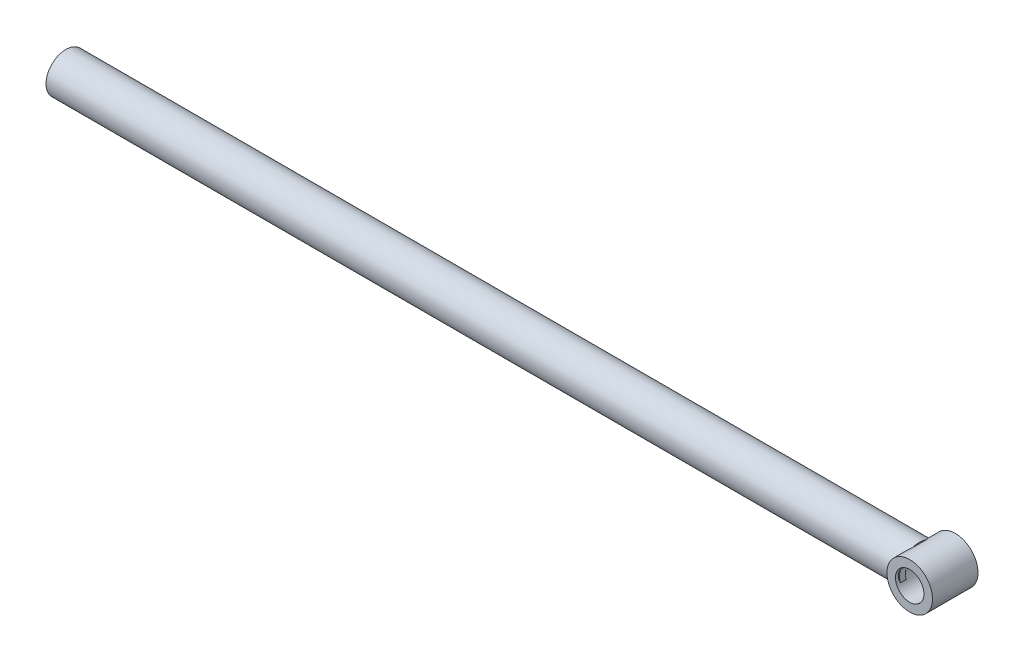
ISO-10303-21;
HEADER;
FILE_DESCRIPTION(('STEP AP214'),'2;1');
FILE_NAME('part.step','',(''),(''),'','','');
FILE_SCHEMA(('AUTOMOTIVE_DESIGN { 1 0 10303 214 1 1 1 1 }'));
ENDSEC;
DATA;
#1=APPLICATION_CONTEXT('core data for automotive mechanical design processes');
#2=APPLICATION_PROTOCOL_DEFINITION('international standard','automotive_design',2000,#1);
#3=PRODUCT_CONTEXT('',#1,'mechanical');
#4=PRODUCT('Part','Part','',(#3));
#5=PRODUCT_RELATED_PRODUCT_CATEGORY('part','',(#4));
#6=PRODUCT_DEFINITION_FORMATION('','',#4);
#7=PRODUCT_DEFINITION_CONTEXT('part definition',#1,'design');
#8=PRODUCT_DEFINITION('design','',#6,#7);
#9=PRODUCT_DEFINITION_SHAPE('','',#8);
#10=(LENGTH_UNIT() NAMED_UNIT(*) SI_UNIT(.MILLI.,.METRE.));
#11=(NAMED_UNIT(*) PLANE_ANGLE_UNIT() SI_UNIT($,.RADIAN.));
#12=(NAMED_UNIT(*) SI_UNIT($,.STERADIAN.) SOLID_ANGLE_UNIT());
#13=UNCERTAINTY_MEASURE_WITH_UNIT(LENGTH_MEASURE(1.E-05),#10,'distance_accuracy_value','');
#14=(GEOMETRIC_REPRESENTATION_CONTEXT(3) GLOBAL_UNCERTAINTY_ASSIGNED_CONTEXT((#13)) GLOBAL_UNIT_ASSIGNED_CONTEXT((#10,
#11,#12)) REPRESENTATION_CONTEXT('',''));
#15=CARTESIAN_POINT('',(0.,0.,0.));
#16=DIRECTION('',(0.,0.,1.));
#17=DIRECTION('',(1.,0.,0.));
#18=AXIS2_PLACEMENT_3D('',#15,#16,#17);
#19=CARTESIAN_POINT('',(282.839330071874,0.,16.));
#20=DIRECTION('',(0.,0.,-1.));
#21=DIRECTION('',(-1.,0.,0.));
#22=AXIS2_PLACEMENT_3D('',#19,#20,#21);
#23=CYLINDRICAL_SURFACE('',#22,7.99999999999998);
#24=CARTESIAN_POINT('',(282.839330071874,0.,0.));
#25=DIRECTION('',(0.,0.,1.));
#26=DIRECTION('',(1.,0.,0.));
#27=AXIS2_PLACEMENT_3D('',#24,#25,#26);
#28=CIRCLE('',#27,7.99999999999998);
#29=CARTESIAN_POINT('',(290.839330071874,0.,0.));
#30=VERTEX_POINT('',#29);
#31=EDGE_CURVE('E199',#30,#30,#28,.T.);
#32=ORIENTED_EDGE('',*,*,#31,.T.);
#33=EDGE_LOOP('',(#32));
#34=FACE_BOUND('',#33,.T.);
#35=CARTESIAN_POINT('',(282.839330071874,0.,16.));
#36=DIRECTION('',(0.,0.,1.));
#37=DIRECTION('',(1.,0.,0.));
#38=AXIS2_PLACEMENT_3D('',#35,#36,#37);
#39=CIRCLE('',#38,7.99999999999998);
#40=CARTESIAN_POINT('',(290.839330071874,0.,16.));
#41=VERTEX_POINT('',#40);
#42=EDGE_CURVE('E198',#41,#41,#39,.T.);
#43=ORIENTED_EDGE('',*,*,#42,.F.);
#44=EDGE_LOOP('',(#43));
#45=FACE_BOUND('',#44,.T.);
#46=CARTESIAN_POINT('',(274.839330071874,0.,15.));
#47=CARTESIAN_POINT('',(274.839328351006,0.163724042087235,15.0000017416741));
#48=CARTESIAN_POINT('',(274.844364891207,0.32742876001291,14.9942475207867));
#49=CARTESIAN_POINT('',(274.864392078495,0.653485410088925,14.971346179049));
#50=CARTESIAN_POINT('',(274.879386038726,0.81583687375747,14.9541952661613));
#51=CARTESIAN_POINT('',(274.919011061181,1.13794041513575,14.9088042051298));
#52=CARTESIAN_POINT('',(274.943651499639,1.29768980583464,14.8805532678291));
#53=CARTESIAN_POINT('',(275.002047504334,1.6133123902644,14.8134624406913));
#54=CARTESIAN_POINT('',(275.035807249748,1.76918377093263,14.7746176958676));
#55=CARTESIAN_POINT('',(275.111498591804,2.07490712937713,14.6872902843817));
#56=CARTESIAN_POINT('',(275.153371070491,2.22479372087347,14.6388772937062));
#57=CARTESIAN_POINT('',(275.2446868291,2.51895954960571,14.5329412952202));
#58=CARTESIAN_POINT('',(275.294133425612,2.66323629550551,14.4754142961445));
#59=CARTESIAN_POINT('',(275.45263866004,3.08665189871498,14.2902560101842));
#60=CARTESIAN_POINT('',(275.571924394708,3.35661746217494,14.149976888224));
#61=CARTESIAN_POINT('',(275.791390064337,3.79029989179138,13.888702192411));
#62=CARTESIAN_POINT('',(275.886261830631,3.96126665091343,13.774922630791));
#63=CARTESIAN_POINT('',(276.083940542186,4.28968393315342,13.5353299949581));
#64=CARTESIAN_POINT('',(276.186747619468,4.44713423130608,13.4095167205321));
#65=CARTESIAN_POINT('',(276.398575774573,4.74876339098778,13.1467831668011));
#66=CARTESIAN_POINT('',(276.507611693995,4.89290821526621,13.0098359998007));
#67=CARTESIAN_POINT('',(276.72972233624,5.16757907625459,12.7260047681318));
#68=CARTESIAN_POINT('',(276.842796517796,5.29810692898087,12.5791220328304));
#69=CARTESIAN_POINT('',(277.073468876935,5.54837096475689,12.2726538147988));
#70=CARTESIAN_POINT('',(277.191112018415,5.66781321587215,12.1128625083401));
#71=CARTESIAN_POINT('',(277.426217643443,5.89276496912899,11.783531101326));
#72=CARTESIAN_POINT('',(277.543680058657,5.99827008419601,11.6139879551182));
#73=CARTESIAN_POINT('',(277.775276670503,6.19502911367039,11.2652165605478));
#74=CARTESIAN_POINT('',(277.889416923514,6.28631047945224,11.0860078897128));
#75=CARTESIAN_POINT('',(278.110701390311,6.45440488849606,10.716937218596));
#76=CARTESIAN_POINT('',(278.217850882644,6.53122893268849,10.5270834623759));
#77=CARTESIAN_POINT('',(278.422849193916,6.67162261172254,10.1296053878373));
#78=CARTESIAN_POINT('',(278.520326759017,6.73473024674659,9.92162054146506));
#79=CARTESIAN_POINT('',(278.693428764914,6.84265498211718,9.49226449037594));
#80=CARTESIAN_POINT('',(278.769095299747,6.88750738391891,9.27092008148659));
#81=CARTESIAN_POINT('',(278.878240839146,6.95076975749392,8.85119634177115));
#82=CARTESIAN_POINT('',(278.916429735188,6.97219317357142,8.65454786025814));
#83=CARTESIAN_POINT('',(278.962843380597,6.99811683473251,8.25673625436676));
#84=CARTESIAN_POINT('',(278.971115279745,7.00264370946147,8.05558073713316));
#85=CARTESIAN_POINT('',(278.956168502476,6.99436184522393,7.65487564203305));
#86=CARTESIAN_POINT('',(278.932947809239,6.98155199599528,7.45532616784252));
#87=CARTESIAN_POINT('',(278.859293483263,6.93981278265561,7.06291699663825));
#88=CARTESIAN_POINT('',(278.808805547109,6.91085124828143,6.87007146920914));
#89=CARTESIAN_POINT('',(278.699646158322,6.84588885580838,6.53117623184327));
#90=CARTESIAN_POINT('',(278.644573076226,6.81241634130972,6.38341990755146));
#91=CARTESIAN_POINT('',(278.524763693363,6.73717463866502,6.09399804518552));
#92=CARTESIAN_POINT('',(278.460020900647,6.69539987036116,5.95233668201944));
#93=CARTESIAN_POINT('',(278.323430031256,6.60404572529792,5.67447830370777));
#94=CARTESIAN_POINT('',(278.251557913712,6.55443958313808,5.53830211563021));
#95=CARTESIAN_POINT('',(278.103069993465,6.4479610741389,5.271555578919));
#96=CARTESIAN_POINT('',(278.026454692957,6.39108947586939,5.14098463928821));
#97=CARTESIAN_POINT('',(277.822660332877,6.23363212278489,4.80725217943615));
#98=CARTESIAN_POINT('',(277.693041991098,6.12748053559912,4.60818566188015));
#99=CARTESIAN_POINT('',(277.430988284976,5.89748468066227,4.22242025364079));
#100=CARTESIAN_POINT('',(277.29855137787,5.77363049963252,4.03572837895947));
#101=CARTESIAN_POINT('',(277.034787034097,5.50837618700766,3.67474055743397));
#102=CARTESIAN_POINT('',(276.903458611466,5.36699391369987,3.50043227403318));
#103=CARTESIAN_POINT('',(276.645036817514,5.06656271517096,3.16463890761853));
#104=CARTESIAN_POINT('',(276.517941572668,4.90752174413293,3.00314810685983));
#105=CARTESIAN_POINT('',(276.203330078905,4.47964122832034,2.60952540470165));
#106=CARTESIAN_POINT('',(276.020603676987,4.19817525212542,2.38681885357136));
#107=CARTESIAN_POINT('',(275.767716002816,3.74463682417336,2.08300847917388));
#108=CARTESIAN_POINT('',(275.686978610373,3.5882950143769,1.98680865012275));
#109=CARTESIAN_POINT('',(275.533892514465,3.26534173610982,1.80550265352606));
#110=CARTESIAN_POINT('',(275.461542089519,3.09873238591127,1.7203942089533));
#111=CARTESIAN_POINT('',(275.339478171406,2.78828996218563,1.57747086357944));
#112=CARTESIAN_POINT('',(275.288069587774,2.64609387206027,1.51753646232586));
#113=CARTESIAN_POINT('',(275.192566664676,2.35591270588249,1.40653411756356));
#114=CARTESIAN_POINT('',(275.148470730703,2.2079289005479,1.35546424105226));
#115=CARTESIAN_POINT('',(275.068361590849,1.90690771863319,1.26290209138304));
#116=CARTESIAN_POINT('',(275.03234569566,1.75387204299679,1.22140663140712));
#117=CARTESIAN_POINT('',(274.969064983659,1.44360340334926,1.14862085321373));
#118=CARTESIAN_POINT('',(274.941800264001,1.28637039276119,1.1173306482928));
#119=CARTESIAN_POINT('',(274.896466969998,0.967948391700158,1.06535964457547));
#120=CARTESIAN_POINT('',(274.878449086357,0.806742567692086,1.04473732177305));
#121=CARTESIAN_POINT('',(274.852236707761,0.48248749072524,1.01475028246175));
#122=CARTESIAN_POINT('',(274.84404223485,0.319438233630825,1.0053855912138));
#123=CARTESIAN_POINT('',(274.837667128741,-0.00708308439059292,0.99809933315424));
#124=CARTESIAN_POINT('',(274.839484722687,-0.170555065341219,1.00017574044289));
#125=CARTESIAN_POINT('',(274.853087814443,-0.496530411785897,1.0157262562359));
#126=CARTESIAN_POINT('',(274.864872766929,-0.659033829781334,1.02919974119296));
#127=CARTESIAN_POINT('',(274.89669253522,-0.967707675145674,1.06562463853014));
#128=CARTESIAN_POINT('',(274.915923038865,-1.11407211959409,1.08765250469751));
#129=CARTESIAN_POINT('',(274.962122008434,-1.40397525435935,1.1406577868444));
#130=CARTESIAN_POINT('',(274.989093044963,-1.54751298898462,1.17163817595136));
#131=CARTESIAN_POINT('',(275.050304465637,-1.8308689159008,1.24209906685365));
#132=CARTESIAN_POINT('',(275.084543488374,-1.97068779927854,1.28157797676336));
#133=CARTESIAN_POINT('',(275.159749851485,-2.24598403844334,1.36852769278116));
#134=CARTESIAN_POINT('',(275.200719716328,-2.38145974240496,1.41600149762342));
#135=CARTESIAN_POINT('',(275.338694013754,-2.79813547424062,1.57639736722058));
#136=CARTESIAN_POINT('',(275.446646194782,-3.07076546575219,1.70259154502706));
#137=CARTESIAN_POINT('',(275.684437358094,-3.59016655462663,1.98351448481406));
#138=CARTESIAN_POINT('',(275.814278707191,-3.83693485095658,2.13824633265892));
#139=CARTESIAN_POINT('',(276.056609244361,-4.24698319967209,2.43130757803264));
#140=CARTESIAN_POINT('',(276.165684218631,-4.4160082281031,2.5645325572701));
#141=CARTESIAN_POINT('',(276.390725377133,-4.73858300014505,2.84332604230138));
#142=CARTESIAN_POINT('',(276.506692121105,-4.89213148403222,2.98889555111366));
#143=CARTESIAN_POINT('',(276.743779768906,-5.18458115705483,3.29205801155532));
#144=CARTESIAN_POINT('',(276.86492418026,-5.32340267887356,3.44970912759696));
#145=CARTESIAN_POINT('',(277.109329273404,-5.58562404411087,3.77571760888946));
#146=CARTESIAN_POINT('',(277.232589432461,-5.70902763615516,3.94407235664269));
#147=CARTESIAN_POINT('',(277.481338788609,-5.94321112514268,4.2954279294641));
#148=CARTESIAN_POINT('',(277.606813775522,-6.05363394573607,4.47867710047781));
#149=CARTESIAN_POINT('',(277.853545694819,-6.25840614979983,4.85696480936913));
#150=CARTESIAN_POINT('',(277.974798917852,-6.3527416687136,5.05201332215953));
#151=CARTESIAN_POINT('',(278.207079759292,-6.52402590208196,5.45354776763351));
#152=CARTESIAN_POINT('',(278.31817017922,-6.60108637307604,5.65994874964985));
#153=CARTESIAN_POINT('',(278.523428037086,-6.73706704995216,6.08638654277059));
#154=CARTESIAN_POINT('',(278.617632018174,-6.79602662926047,6.30639248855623));
#155=CARTESIAN_POINT('',(278.767412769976,-6.88666599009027,6.72965426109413));
#156=CARTESIAN_POINT('',(278.826529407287,-6.9209904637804,6.93102016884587));
#157=CARTESIAN_POINT('',(278.893588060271,-6.95929370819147,7.23911414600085));
#158=CARTESIAN_POINT('',(278.912330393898,-6.96986028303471,7.34271495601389));
#159=CARTESIAN_POINT('',(278.941817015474,-6.9863928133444,7.55139195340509));
#160=CARTESIAN_POINT('',(278.952565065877,-6.99236093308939,7.65646742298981));
#161=CARTESIAN_POINT('',(278.965550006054,-6.99956317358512,7.86807449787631));
#162=CARTESIAN_POINT('',(278.96772485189,-7.00076278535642,7.97461113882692));
#163=CARTESIAN_POINT('',(278.963273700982,-6.99829932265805,8.18743853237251));
#164=CARTESIAN_POINT('',(278.956647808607,-6.99463630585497,8.2937292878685));
#165=CARTESIAN_POINT('',(278.934938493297,-6.98254084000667,8.50534458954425));
#166=CARTESIAN_POINT('',(278.919840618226,-6.97410024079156,8.61066717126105));
#167=CARTESIAN_POINT('',(278.881937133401,-6.95266262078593,8.81946436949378));
#168=CARTESIAN_POINT('',(278.859127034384,-6.93966294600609,8.9229378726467));
#169=CARTESIAN_POINT('',(278.763238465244,-6.88417765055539,9.29761483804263));
#170=CARTESIAN_POINT('',(278.669614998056,-6.82859142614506,9.5618079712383));
#171=CARTESIAN_POINT('',(278.507731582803,-6.72617234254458,9.94323048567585));
#172=CARTESIAN_POINT('',(278.450053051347,-6.68876141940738,10.0681380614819));
#173=CARTESIAN_POINT('',(278.329306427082,-6.60794673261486,10.3133630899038));
#174=CARTESIAN_POINT('',(278.266239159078,-6.56454388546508,10.4336812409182));
#175=CARTESIAN_POINT('',(278.088938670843,-6.43837887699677,10.7559828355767));
#176=CARTESIAN_POINT('',(277.970883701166,-6.3499673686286,10.9536463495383));
#177=CARTESIAN_POINT('',(277.729005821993,-6.15699617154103,11.337288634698));
#178=CARTESIAN_POINT('',(277.605179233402,-6.05242608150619,11.5232597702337));
#179=CARTESIAN_POINT('',(277.355612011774,-5.8272745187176,11.8843521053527));
#180=CARTESIAN_POINT('',(277.229868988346,-5.70667130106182,12.059458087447));
#181=CARTESIAN_POINT('',(276.979778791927,-5.44957158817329,12.3985703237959));
#182=CARTESIAN_POINT('',(276.855431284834,-5.31307899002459,12.5625792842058));
#183=CARTESIAN_POINT('',(276.606379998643,-5.01884483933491,12.8847170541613));
#184=CARTESIAN_POINT('',(276.481822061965,-4.86051854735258,13.0424267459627));
#185=CARTESIAN_POINT('',(276.239766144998,-4.52640250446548,13.3443780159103));
#186=CARTESIAN_POINT('',(276.122269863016,-4.35060857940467,13.4886163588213));
#187=CARTESIAN_POINT('',(275.897533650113,-3.98219622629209,13.7614665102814));
#188=CARTESIAN_POINT('',(275.79026346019,-3.78963087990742,13.8901247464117));
#189=CARTESIAN_POINT('',(275.588561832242,-3.38774491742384,14.1300781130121));
#190=CARTESIAN_POINT('',(275.494121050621,-3.17843667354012,14.2413858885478));
#191=CARTESIAN_POINT('',(275.352602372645,-2.82330074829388,14.407200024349));
#192=CARTESIAN_POINT('',(275.300795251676,-2.68208966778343,14.4676367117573));
#193=CARTESIAN_POINT('',(275.204381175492,-2.39387249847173,14.5797618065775));
#194=CARTESIAN_POINT('',(275.159772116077,-2.24686811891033,14.631452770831));
#195=CARTESIAN_POINT('',(275.078572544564,-1.94796892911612,14.7253186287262));
#196=CARTESIAN_POINT('',(275.041968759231,-1.79608270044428,14.7675092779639));
#197=CARTESIAN_POINT('',(274.977380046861,-1.48811711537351,14.841826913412));
#198=CARTESIAN_POINT('',(274.949392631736,-1.33203898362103,14.8739568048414));
#199=CARTESIAN_POINT('',(274.897433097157,-0.981884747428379,14.9335408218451));
#200=CARTESIAN_POINT('',(274.875708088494,-0.787020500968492,14.9584006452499));
#201=CARTESIAN_POINT('',(274.846655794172,-0.394761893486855,14.9916312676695));
#202=CARTESIAN_POINT('',(274.839332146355,-0.197366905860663,14.9999979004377));
#203=CARTESIAN_POINT('',(274.839330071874,0.,15.));
#204=B_SPLINE_CURVE_WITH_KNOTS('',3,(#46,#47,#48,#49,#50,#51,#52,#53,#54,#55,#56,#57,#58,#59,
#60,#61,#62,#63,#64,#65,#66,#67,#68,#69,#70,#71,#72,#73,#74,#75,#76,#77,#78,#79,#80,#81,#82,#83,
#84,#85,#86,#87,#88,#89,#90,#91,#92,#93,#94,#95,#96,#97,#98,#99,#100,#101,#102,#103,#104,#105,
#106,#107,#108,#109,#110,#111,#112,#113,#114,#115,#116,#117,#118,#119,#120,#121,#122,#123,#124,
#125,#126,#127,#128,#129,#130,#131,#132,#133,#134,#135,#136,#137,#138,#139,#140,#141,#142,#143,
#144,#145,#146,#147,#148,#149,#150,#151,#152,#153,#154,#155,#156,#157,#158,#159,#160,#161,#162,
#163,#164,#165,#166,#167,#168,#169,#170,#171,#172,#173,#174,#175,#176,#177,#178,#179,#180,#181,
#182,#183,#184,#185,#186,#187,#188,#189,#190,#191,#192,#193,#194,#195,#196,#197,#198,#199,#200,
#201,#202,#203),.UNSPECIFIED.,.T.,.F.,(4,2,2,2,2,2,2,2,2,2,2,2,2,2,2,2,2,2,2,2,2,2,2,2,2,2,2,2,
2,2,2,2,2,2,2,2,2,2,2,2,2,2,2,2,2,2,2,2,2,2,2,2,2,2,2,2,2,2,2,2,2,2,2,2,2,2,2,2,2,2,2,2,2,2,2,2,
2,2,4),(0.,0.490962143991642,0.982087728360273,1.47369186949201,1.9655216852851,
2.45389385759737,2.9424804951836,3.91888541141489,4.59678044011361,5.27468674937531,
5.95428177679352,6.63378605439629,7.32796484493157,8.02236162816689,8.71540119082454,
9.40791125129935,10.1210113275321,10.8327258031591,11.4345523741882,12.035430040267,
12.6363461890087,13.2384635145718,13.7213892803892,14.2046407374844,14.6895810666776,
15.1744701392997,15.9539617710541,16.7338916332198,17.5130333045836,18.2918254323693,
19.4947482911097,20.0957841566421,20.6966964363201,21.1841822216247,21.6715615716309,
22.1587784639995,22.6460007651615,23.135866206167,23.6257327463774,24.1155125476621,
24.6052655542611,25.0525349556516,25.4999530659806,25.9472874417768,26.3947899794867,
27.3486656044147,28.3026444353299,29.0255632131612,29.7485407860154,30.4752488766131,
31.2017799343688,31.9450787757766,32.6890150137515,33.4279899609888,34.1653458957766,
34.8007517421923,35.1178324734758,35.4347638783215,35.7539847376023,36.0732018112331,
36.3929650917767,36.7129148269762,37.5645455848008,37.9921463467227,38.4196817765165,
39.1584884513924,39.8977726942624,40.6380700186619,41.3781861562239,42.1447315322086,
42.911460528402,43.6758453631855,44.4396704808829,44.9255404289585,45.4112680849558,
45.8961841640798,46.3809600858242,46.9726582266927,47.5645058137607),.UNSPECIFIED.);
#205=CARTESIAN_POINT('',(278.267706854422,6.56507891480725,5.57106219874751));
#206=VERTEX_POINT('',#205);
#207=CARTESIAN_POINT('',(278.267706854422,-6.56507891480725,5.57106219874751));
#208=VERTEX_POINT('',#207);
#209=EDGE_CURVE('E48',#206,#208,#204,.T.);
#210=ORIENTED_EDGE('',*,*,#209,.F.);
#211=DIRECTION('',(0.,0.,-1.));
#212=VECTOR('',#211,1.);
#213=CARTESIAN_POINT('',(278.267706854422,6.56507891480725,16.));
#214=LINE('',#213,#212);
#215=CARTESIAN_POINT('',(278.267706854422,6.56507891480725,10.4289378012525));
#216=VERTEX_POINT('',#215);
#217=EDGE_CURVE('E81',#216,#206,#214,.T.);
#218=ORIENTED_EDGE('',*,*,#217,.F.);
#219=CARTESIAN_POINT('',(278.267706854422,-6.56507891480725,10.4289378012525));
#220=VERTEX_POINT('',#219);
#221=EDGE_CURVE('E83',#220,#216,#204,.T.);
#222=ORIENTED_EDGE('',*,*,#221,.F.);
#223=DIRECTION('',(0.,0.,-1.));
#224=VECTOR('',#223,1.);
#225=CARTESIAN_POINT('',(278.267706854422,-6.56507891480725,16.));
#226=LINE('',#225,#224);
#227=EDGE_CURVE('E53',#208,#220,#226,.F.);
#228=ORIENTED_EDGE('',*,*,#227,.F.);
#229=EDGE_LOOP('',(#210,#218,#222,#228));
#230=FACE_BOUND('',#229,.T.);
#231=ADVANCED_FACE('F31',(#34,#45,#230),#23,.T.);
#232=CARTESIAN_POINT('',(282.839330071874,0.,16.));
#233=DIRECTION('',(0.,0.,-1.));
#234=DIRECTION('',(-1.,0.,0.));
#235=AXIS2_PLACEMENT_3D('',#232,#233,#234);
#236=CYLINDRICAL_SURFACE('',#235,4.99999999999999);
#237=DIRECTION('',(0.,0.,-1.));
#238=VECTOR('',#237,1.);
#239=CARTESIAN_POINT('',(278.267706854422,2.02491016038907,16.));
#240=LINE('',#239,#238);
#241=CARTESIAN_POINT('',(278.267706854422,2.02491016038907,14.7007267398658));
#242=VERTEX_POINT('',#241);
#243=CARTESIAN_POINT('',(278.267706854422,2.02491016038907,12.5716232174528));
#244=VERTEX_POINT('',#243);
#245=EDGE_CURVE('E177',#242,#244,#240,.T.);
#246=ORIENTED_EDGE('',*,*,#245,.T.);
#247=CARTESIAN_POINT('',(282.839330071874,0.,8.));
#248=DIRECTION('',(-0.707106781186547,0.,-0.707106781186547));
#249=DIRECTION('',(0.707106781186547,0.,-0.707106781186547));
#250=AXIS2_PLACEMENT_3D('',#247,#248,#249);
#251=ELLIPSE('',#250,7.07106781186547,5.);
#252=CARTESIAN_POINT('',(278.267706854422,-2.02491016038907,12.5716232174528));
#253=VERTEX_POINT('',#252);
#254=EDGE_CURVE('E173',#244,#253,#251,.F.);
#255=ORIENTED_EDGE('',*,*,#254,.T.);
#256=DIRECTION('',(0.,0.,-1.));
#257=VECTOR('',#256,1.);
#258=CARTESIAN_POINT('',(278.267706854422,-2.02491016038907,16.));
#259=LINE('',#258,#257);
#260=CARTESIAN_POINT('',(278.267706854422,-2.02491016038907,14.7007267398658));
#261=VERTEX_POINT('',#260);
#262=EDGE_CURVE('E180',#253,#261,#259,.F.);
#263=ORIENTED_EDGE('',*,*,#262,.T.);
#264=CARTESIAN_POINT('',(278.267706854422,-2.02491016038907,14.7007267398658));
#265=CARTESIAN_POINT('',(278.221047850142,-1.91959734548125,14.7325665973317));
#266=CARTESIAN_POINT('',(278.177803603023,-1.81210802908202,14.7623246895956));
#267=CARTESIAN_POINT('',(278.098550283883,-1.593275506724,14.8171952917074));
#268=CARTESIAN_POINT('',(278.062545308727,-1.4819301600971,14.8423051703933));
#269=CARTESIAN_POINT('',(277.998284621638,-1.25619730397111,14.8873218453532));
#270=CARTESIAN_POINT('',(277.970015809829,-1.14181530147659,14.9072374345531));
#271=CARTESIAN_POINT('',(277.921522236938,-0.910559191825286,14.9415083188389));
#272=CARTESIAN_POINT('',(277.901295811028,-0.793685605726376,14.9558647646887));
#273=CARTESIAN_POINT('',(277.869103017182,-0.55774250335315,14.9787555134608));
#274=CARTESIAN_POINT('',(277.857170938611,-0.438665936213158,14.9872656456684));
#275=CARTESIAN_POINT('',(277.841881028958,-0.199629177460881,14.9981760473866));
#276=CARTESIAN_POINT('',(277.838527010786,-0.0796686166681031,15.0005735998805));
#277=CARTESIAN_POINT('',(277.840456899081,0.16013735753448,14.9991951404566));
#278=CARTESIAN_POINT('',(277.845740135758,0.279982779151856,14.9954196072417));
#279=CARTESIAN_POINT('',(277.864856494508,0.518584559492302,14.9817864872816));
#280=CARTESIAN_POINT('',(277.878685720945,0.637341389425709,14.9719316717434));
#281=CARTESIAN_POINT('',(277.913607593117,0.865921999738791,14.9471289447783));
#282=CARTESIAN_POINT('',(277.934218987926,0.975856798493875,14.9325190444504));
#283=CARTESIAN_POINT('',(277.982557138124,1.19338740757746,14.8984020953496));
#284=CARTESIAN_POINT('',(278.010284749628,1.30098293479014,14.8788944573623));
#285=CARTESIAN_POINT('',(278.072567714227,1.51335090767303,14.8353144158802));
#286=CARTESIAN_POINT('',(278.107130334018,1.61812021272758,14.8112371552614));
#287=CARTESIAN_POINT('',(278.182686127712,1.82420665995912,14.7589649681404));
#288=CARTESIAN_POINT('',(278.223676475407,1.92552529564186,14.7307718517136));
#289=CARTESIAN_POINT('',(278.267706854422,2.02491016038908,14.7007267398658));
#290=B_SPLINE_CURVE_WITH_KNOTS('',3,(#264,#265,#266,#267,#268,#269,#270,#271,#272,#273,#274,
#275,#276,#277,#278,#279,#280,#281,#282,#283,#284,#285,#286,#287,#288,#289),.UNSPECIFIED.,.F.,
.F.,(4,2,2,2,2,2,2,2,2,2,2,2,4),(0.,0.358476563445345,0.717155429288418,1.07522312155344,
1.43321665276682,1.79268148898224,2.15230607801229,2.51190278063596,2.87133568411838,
3.20937754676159,3.54746009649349,3.88590403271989,4.22419957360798),.UNSPECIFIED.);
#291=EDGE_CURVE('E182',#261,#242,#290,.T.);
#292=ORIENTED_EDGE('',*,*,#291,.T.);
#293=EDGE_LOOP('',(#246,#255,#263,#292));
#294=FACE_BOUND('',#293,.T.);
#295=CARTESIAN_POINT('',(282.839330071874,0.,16.));
#296=DIRECTION('',(0.,0.,1.));
#297=DIRECTION('',(1.,0.,0.));
#298=AXIS2_PLACEMENT_3D('',#295,#296,#297);
#299=CIRCLE('',#298,4.99999999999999);
#300=CARTESIAN_POINT('',(287.839330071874,0.,16.));
#301=VERTEX_POINT('',#300);
#302=EDGE_CURVE('E218',#301,#301,#299,.T.);
#303=ORIENTED_EDGE('',*,*,#302,.T.);
#304=EDGE_LOOP('',(#303));
#305=FACE_BOUND('',#304,.T.);
#306=CARTESIAN_POINT('',(282.839330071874,0.,0.));
#307=DIRECTION('',(0.,0.,1.));
#308=DIRECTION('',(1.,0.,0.));
#309=AXIS2_PLACEMENT_3D('',#306,#307,#308);
#310=CIRCLE('',#309,4.99999999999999);
#311=CARTESIAN_POINT('',(287.839330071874,0.,0.));
#312=VERTEX_POINT('',#311);
#313=EDGE_CURVE('E87',#312,#312,#310,.T.);
#314=ORIENTED_EDGE('',*,*,#313,.F.);
#315=EDGE_LOOP('',(#314));
#316=FACE_BOUND('',#315,.T.);
#317=CARTESIAN_POINT('',(278.267706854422,-2.02491016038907,1.29927326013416));
#318=VERTEX_POINT('',#317);
#319=CARTESIAN_POINT('',(278.267706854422,-2.02491016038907,3.42837678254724));
#320=VERTEX_POINT('',#319);
#321=EDGE_CURVE('E186',#318,#320,#259,.F.);
#322=ORIENTED_EDGE('',*,*,#321,.T.);
#323=CARTESIAN_POINT('',(282.839330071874,0.,8.));
#324=DIRECTION('',(0.707106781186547,0.,-0.707106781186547));
#325=DIRECTION('',(-0.707106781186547,0.,-0.707106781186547));
#326=AXIS2_PLACEMENT_3D('',#323,#324,#325);
#327=ELLIPSE('',#326,7.07106781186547,5.);
#328=CARTESIAN_POINT('',(278.267706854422,2.02491016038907,3.42837678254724));
#329=VERTEX_POINT('',#328);
#330=EDGE_CURVE('E36',#320,#329,#327,.T.);
#331=ORIENTED_EDGE('',*,*,#330,.T.);
#332=CARTESIAN_POINT('',(278.267706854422,2.02491016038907,1.29927326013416));
#333=VERTEX_POINT('',#332);
#334=EDGE_CURVE('E184',#329,#333,#240,.T.);
#335=ORIENTED_EDGE('',*,*,#334,.T.);
#336=CARTESIAN_POINT('',(278.267706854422,2.02491016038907,1.29927326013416));
#337=CARTESIAN_POINT('',(278.221047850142,1.91959734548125,1.26743340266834));
#338=CARTESIAN_POINT('',(278.177803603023,1.81210802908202,1.23767531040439));
#339=CARTESIAN_POINT('',(278.098550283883,1.593275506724,1.18280470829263));
#340=CARTESIAN_POINT('',(278.062545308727,1.4819301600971,1.15769482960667));
#341=CARTESIAN_POINT('',(277.998284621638,1.25619730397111,1.1126781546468));
#342=CARTESIAN_POINT('',(277.970015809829,1.14181530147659,1.09276256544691));
#343=CARTESIAN_POINT('',(277.921522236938,0.910559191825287,1.05849168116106));
#344=CARTESIAN_POINT('',(277.901295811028,0.793685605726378,1.04413523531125));
#345=CARTESIAN_POINT('',(277.869103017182,0.557742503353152,1.02124448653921));
#346=CARTESIAN_POINT('',(277.857170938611,0.438665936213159,1.01273435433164));
#347=CARTESIAN_POINT('',(277.841881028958,0.199629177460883,1.00182395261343));
#348=CARTESIAN_POINT('',(277.838527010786,0.0796686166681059,0.999426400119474));
#349=CARTESIAN_POINT('',(277.840456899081,-0.160137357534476,1.00080485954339));
#350=CARTESIAN_POINT('',(277.845740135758,-0.279982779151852,1.00458039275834));
#351=CARTESIAN_POINT('',(277.864856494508,-0.518584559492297,1.01821351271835));
#352=CARTESIAN_POINT('',(277.878685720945,-0.637341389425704,1.02806832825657));
#353=CARTESIAN_POINT('',(277.913607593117,-0.865921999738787,1.0528710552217));
#354=CARTESIAN_POINT('',(277.934218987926,-0.975856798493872,1.06748095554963));
#355=CARTESIAN_POINT('',(277.982557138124,-1.19338740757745,1.10159790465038));
#356=CARTESIAN_POINT('',(278.010284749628,-1.30098293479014,1.12110554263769));
#357=CARTESIAN_POINT('',(278.072567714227,-1.51335090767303,1.1646855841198));
#358=CARTESIAN_POINT('',(278.107130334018,-1.61812021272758,1.1887628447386));
#359=CARTESIAN_POINT('',(278.182686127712,-1.82420665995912,1.24103503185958));
#360=CARTESIAN_POINT('',(278.223676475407,-1.92552529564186,1.26922814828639));
#361=CARTESIAN_POINT('',(278.267706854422,-2.02491016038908,1.29927326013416));
#362=B_SPLINE_CURVE_WITH_KNOTS('',3,(#336,#337,#338,#339,#340,#341,#342,#343,#344,#345,#346,
#347,#348,#349,#350,#351,#352,#353,#354,#355,#356,#357,#358,#359,#360,#361),.UNSPECIFIED.,.F.,
.F.,(4,2,2,2,2,2,2,2,2,2,2,2,4),(0.,0.358476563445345,0.717155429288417,1.07522312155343,
1.43321665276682,1.79268148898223,2.15230607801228,2.51190278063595,2.87133568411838,
3.2093775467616,3.5474600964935,3.88590403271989,4.22419957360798),.UNSPECIFIED.);
#363=EDGE_CURVE('E176',#333,#318,#362,.T.);
#364=ORIENTED_EDGE('',*,*,#363,.T.);
#365=EDGE_LOOP('',(#322,#331,#335,#364));
#366=FACE_BOUND('',#365,.T.);
#367=ADVANCED_FACE('F137',(#294,#305,#316,#366),#236,.F.);
#368=CARTESIAN_POINT('',(282.839330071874,0.,16.));
#369=DIRECTION('',(0.,0.,1.));
#370=DIRECTION('',(1.,0.,0.));
#371=AXIS2_PLACEMENT_3D('',#368,#369,#370);
#372=PLANE('',#371);
#373=ORIENTED_EDGE('',*,*,#42,.T.);
#374=EDGE_LOOP('',(#373));
#375=FACE_BOUND('',#374,.T.);
#376=ORIENTED_EDGE('',*,*,#302,.F.);
#377=EDGE_LOOP('',(#376));
#378=FACE_BOUND('',#377,.T.);
#379=ADVANCED_FACE('F142',(#375,#378),#372,.T.);
#380=CARTESIAN_POINT('',(282.839330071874,0.,0.));
#381=DIRECTION('',(0.,0.,1.));
#382=DIRECTION('',(1.,0.,0.));
#383=AXIS2_PLACEMENT_3D('',#380,#381,#382);
#384=PLANE('',#383);
#385=ORIENTED_EDGE('',*,*,#31,.F.);
#386=EDGE_LOOP('',(#385));
#387=FACE_BOUND('',#386,.T.);
#388=ORIENTED_EDGE('',*,*,#313,.T.);
#389=EDGE_LOOP('',(#388));
#390=FACE_BOUND('',#389,.T.);
#391=ADVANCED_FACE('F135',(#387,#390),#384,.F.);
#392=CARTESIAN_POINT('',(-116.634609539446,0.,8.));
#393=DIRECTION('',(-1.,0.,0.));
#394=DIRECTION('',(0.,0.,1.));
#395=AXIS2_PLACEMENT_3D('',#392,#393,#394);
#396=CYLINDRICAL_SURFACE('',#395,7.);
#397=ORIENTED_EDGE('',*,*,#291,.F.);
#398=CARTESIAN_POINT('',(278.267706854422,0.,8.));
#399=DIRECTION('',(-1.,0.,0.));
#400=DIRECTION('',(0.,0.,1.));
#401=AXIS2_PLACEMENT_3D('',#398,#399,#400);
#402=CIRCLE('',#401,7.);
#403=EDGE_CURVE('E101',#261,#242,#402,.T.);
#404=ORIENTED_EDGE('',*,*,#403,.T.);
#405=EDGE_LOOP('',(#397,#404));
#406=FACE_BOUND('',#405,.T.);
#407=ADVANCED_FACE('F119',(#406),#396,.T.);
#408=CARTESIAN_POINT('',(278.267706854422,0.,1.));
#409=DIRECTION('',(-1.,0.,0.));
#410=DIRECTION('',(0.,0.,1.));
#411=AXIS2_PLACEMENT_3D('',#408,#409,#410);
#412=PLANE('',#411);
#413=ORIENTED_EDGE('',*,*,#245,.F.);
#414=ORIENTED_EDGE('',*,*,#403,.F.);
#415=ORIENTED_EDGE('',*,*,#262,.F.);
#416=CARTESIAN_POINT('',(278.267706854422,0.,8.));
#417=DIRECTION('',(-1.,0.,0.));
#418=DIRECTION('',(0.,0.,1.));
#419=AXIS2_PLACEMENT_3D('',#416,#417,#418);
#420=CIRCLE('',#419,5.);
#421=EDGE_CURVE('E98',#253,#244,#420,.T.);
#422=ORIENTED_EDGE('',*,*,#421,.T.);
#423=EDGE_LOOP('',(#413,#414,#415,#422));
#424=FACE_BOUND('',#423,.T.);
#425=ADVANCED_FACE('F128',(#424),#412,.F.);
#426=CARTESIAN_POINT('',(-116.634609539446,0.,8.));
#427=DIRECTION('',(-1.,0.,0.));
#428=DIRECTION('',(0.,0.,1.));
#429=AXIS2_PLACEMENT_3D('',#426,#427,#428);
#430=CYLINDRICAL_SURFACE('',#429,5.);
#431=ORIENTED_EDGE('',*,*,#254,.F.);
#432=ORIENTED_EDGE('',*,*,#421,.F.);
#433=EDGE_LOOP('',(#431,#432));
#434=FACE_BOUND('',#433,.T.);
#435=ADVANCED_FACE('F132',(#434),#430,.F.);
#436=ORIENTED_EDGE('',*,*,#363,.F.);
#437=EDGE_CURVE('E99',#333,#318,#402,.T.);
#438=ORIENTED_EDGE('',*,*,#437,.T.);
#439=EDGE_LOOP('',(#436,#438));
#440=FACE_BOUND('',#439,.T.);
#441=ADVANCED_FACE('F118',(#440),#396,.T.);
#442=ORIENTED_EDGE('',*,*,#334,.F.);
#443=EDGE_CURVE('E103',#329,#320,#420,.T.);
#444=ORIENTED_EDGE('',*,*,#443,.T.);
#445=ORIENTED_EDGE('',*,*,#321,.F.);
#446=ORIENTED_EDGE('',*,*,#437,.F.);
#447=EDGE_LOOP('',(#442,#444,#445,#446));
#448=FACE_BOUND('',#447,.T.);
#449=ADVANCED_FACE('F131',(#448),#412,.F.);
#450=ORIENTED_EDGE('',*,*,#330,.F.);
#451=ORIENTED_EDGE('',*,*,#443,.F.);
#452=EDGE_LOOP('',(#450,#451));
#453=FACE_BOUND('',#452,.T.);
#454=ADVANCED_FACE('F155',(#453),#430,.F.);
#455=CARTESIAN_POINT('',(-21.7322931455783,0.,8.));
#456=DIRECTION('',(-1.,0.,0.));
#457=DIRECTION('',(0.,0.,1.));
#458=AXIS2_PLACEMENT_3D('',#455,#456,#457);
#459=CIRCLE('',#458,5.);
#460=CARTESIAN_POINT('',(-21.7322931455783,0.,13.));
#461=VERTEX_POINT('',#460);
#462=EDGE_CURVE('E95',#461,#461,#459,.T.);
#463=ORIENTED_EDGE('',*,*,#462,.T.);
#464=EDGE_LOOP('',(#463));
#465=FACE_BOUND('',#464,.T.);
#466=CARTESIAN_POINT('',(274.839330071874,0.,13.));
#467=CARTESIAN_POINT('',(274.839330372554,-0.127079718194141,12.999999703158));
#468=CARTESIAN_POINT('',(274.842364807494,-0.254165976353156,12.9951487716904));
#469=CARTESIAN_POINT('',(274.854428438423,-0.50736568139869,12.9758125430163));
#470=CARTESIAN_POINT('',(274.863460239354,-0.633478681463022,12.9613230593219));
#471=CARTESIAN_POINT('',(274.887311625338,-0.883879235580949,12.9228878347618));
#472=CARTESIAN_POINT('',(274.902139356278,-1.00816396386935,12.898928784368));
#473=CARTESIAN_POINT('',(274.937229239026,-1.25388007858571,12.8418697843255));
#474=CARTESIAN_POINT('',(274.957493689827,-1.3753102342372,12.8087659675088));
#475=CARTESIAN_POINT('',(275.002864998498,-1.61383677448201,12.7340323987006));
#476=CARTESIAN_POINT('',(275.02794495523,-1.73095311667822,12.6924499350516));
#477=CARTESIAN_POINT('',(275.082475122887,-1.96091650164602,12.6011015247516));
#478=CARTESIAN_POINT('',(275.111927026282,-2.07376186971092,12.551332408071));
#479=CARTESIAN_POINT('',(275.20592298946,-2.40491190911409,12.3905033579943));
#480=CARTESIAN_POINT('',(275.276160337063,-2.6160984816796,12.2678365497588));
#481=CARTESIAN_POINT('',(275.432527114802,-3.03193014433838,11.9844460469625));
#482=CARTESIAN_POINT('',(275.519477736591,-3.23470598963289,11.821465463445));
#483=CARTESIAN_POINT('',(275.69808994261,-3.61195776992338,11.4671006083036));
#484=CARTESIAN_POINT('',(275.789757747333,-3.78639500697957,11.2756781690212));
#485=CARTESIAN_POINT('',(275.930967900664,-4.0355105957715,10.9557142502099));
#486=CARTESIAN_POINT('',(275.981608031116,-4.12074022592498,10.8357128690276));
#487=CARTESIAN_POINT('',(276.080333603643,-4.28074637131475,10.5878489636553));
#488=CARTESIAN_POINT('',(276.128418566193,-4.35552092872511,10.4599849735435));
#489=CARTESIAN_POINT('',(276.220253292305,-4.49385262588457,10.197115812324));
#490=CARTESIAN_POINT('',(276.26400973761,-4.55742717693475,10.0621221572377));
#491=CARTESIAN_POINT('',(276.345478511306,-4.67278116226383,9.78537755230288));
#492=CARTESIAN_POINT('',(276.38319082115,-4.72456056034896,9.64362658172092));
#493=CARTESIAN_POINT('',(276.44195267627,-4.80367778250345,9.39186641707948));
#494=CARTESIAN_POINT('',(276.464786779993,-4.83387146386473,9.28316394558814));
#495=CARTESIAN_POINT('',(276.505416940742,-4.8869893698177,9.06308085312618));
#496=CARTESIAN_POINT('',(276.523214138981,-4.90991524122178,8.95170084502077));
#497=CARTESIAN_POINT('',(276.55314002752,-4.94817199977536,8.72702366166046));
#498=CARTESIAN_POINT('',(276.565275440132,-4.96351189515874,8.61372892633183));
#499=CARTESIAN_POINT('',(276.583453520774,-4.98640391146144,8.3858587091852));
#500=CARTESIAN_POINT('',(276.589495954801,-4.99395573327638,8.27128317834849));
#501=CARTESIAN_POINT('',(276.595253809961,-5.00115324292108,8.04144134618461));
#502=CARTESIAN_POINT('',(276.594953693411,-5.00077951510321,7.92617404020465));
#503=CARTESIAN_POINT('',(276.587999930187,-4.99208386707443,7.69609400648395));
#504=CARTESIAN_POINT('',(276.58134395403,-4.9837590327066,7.58128146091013));
#505=CARTESIAN_POINT('',(276.561934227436,-4.95928874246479,7.35297891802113));
#506=CARTESIAN_POINT('',(276.549178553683,-4.94314081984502,7.23948934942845));
#507=CARTESIAN_POINT('',(276.518052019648,-4.90327193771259,7.01461379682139));
#508=CARTESIAN_POINT('',(276.499678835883,-4.87954784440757,6.9032287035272));
#509=CARTESIAN_POINT('',(276.438030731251,-4.79874186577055,6.57838001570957));
#510=CARTESIAN_POINT('',(276.387702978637,-4.73140686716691,6.36870752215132));
#511=CARTESIAN_POINT('',(276.273505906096,-4.57160139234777,5.96331791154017));
#512=CARTESIAN_POINT('',(276.209631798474,-4.47912202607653,5.76760576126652));
#513=CARTESIAN_POINT('',(276.061140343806,-4.25180409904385,5.35668534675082));
#514=CARTESIAN_POINT('',(275.974877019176,-4.1122797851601,5.14466479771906));
#515=CARTESIAN_POINT('',(275.799090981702,-3.80349790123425,4.74465081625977));
#516=CARTESIAN_POINT('',(275.709564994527,-3.63420977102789,4.55668242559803));
#517=CARTESIAN_POINT('',(275.571077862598,-3.34462792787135,4.28043145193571));
#518=CARTESIAN_POINT('',(275.52076378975,-3.23332743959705,4.18325719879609));
#519=CARTESIAN_POINT('',(275.422816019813,-3.00184758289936,3.9986488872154));
#520=CARTESIAN_POINT('',(275.375181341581,-2.88167150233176,3.91121125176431));
#521=CARTESIAN_POINT('',(275.283847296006,-2.63291547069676,3.74676677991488));
#522=CARTESIAN_POINT('',(275.240148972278,-2.50433330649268,3.66976270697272));
#523=CARTESIAN_POINT('',(275.157946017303,-2.23953943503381,3.52707471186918));
#524=CARTESIAN_POINT('',(275.119438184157,-2.10333250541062,3.46138380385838));
#525=CARTESIAN_POINT('',(275.05062810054,-1.83158498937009,3.34533113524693));
#526=CARTESIAN_POINT('',(275.019997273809,-1.69639792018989,3.29433770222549));
#527=CARTESIAN_POINT('',(274.965288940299,-1.42097512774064,3.20397901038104));
#528=CARTESIAN_POINT('',(274.941207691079,-1.28074233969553,3.16460710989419));
#529=CARTESIAN_POINT('',(274.900336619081,-0.996484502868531,3.09813260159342));
#530=CARTESIAN_POINT('',(274.88354023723,-0.852462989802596,3.07101895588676));
#531=CARTESIAN_POINT('',(274.857757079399,-0.561915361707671,3.02950965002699));
#532=CARTESIAN_POINT('',(274.848768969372,-0.415389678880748,3.01511181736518));
#533=CARTESIAN_POINT('',(274.839631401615,-0.143238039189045,3.000479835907));
#534=CARTESIAN_POINT('',(274.838367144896,-0.0177414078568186,2.99845913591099));
#535=CARTESIAN_POINT('',(274.841740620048,0.232966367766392,3.0038572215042));
#536=CARTESIAN_POINT('',(274.846377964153,0.358177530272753,3.01127538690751));
#537=CARTESIAN_POINT('',(274.861440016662,0.60732783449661,3.03544377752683));
#538=CARTESIAN_POINT('',(274.871864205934,0.731267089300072,3.05219316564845));
#539=CARTESIAN_POINT('',(274.898247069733,0.976969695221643,3.09479069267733));
#540=CARTESIAN_POINT('',(274.914205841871,1.09873300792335,3.12063899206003));
#541=CARTESIAN_POINT('',(274.950556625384,1.33450834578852,3.17990944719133));
#542=CARTESIAN_POINT('',(274.97074894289,1.44863666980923,3.2129926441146));
#543=CARTESIAN_POINT('',(275.015484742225,1.67350231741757,3.28688903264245));
#544=CARTESIAN_POINT('',(275.040029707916,1.78423846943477,3.32770486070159));
#545=CARTESIAN_POINT('',(275.119484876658,2.11043845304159,3.46114977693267));
#546=CARTESIAN_POINT('',(275.180244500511,2.32007565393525,3.56482271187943));
#547=CARTESIAN_POINT('',(275.319735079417,2.74037159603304,3.81007206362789));
#548=CARTESIAN_POINT('',(275.399660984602,2.94899750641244,3.95441813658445));
#549=CARTESIAN_POINT('',(275.567049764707,3.34056091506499,4.27117159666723));
#550=CARTESIAN_POINT('',(275.65452096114,3.52346945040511,4.44361015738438));
#551=CARTESIAN_POINT('',(275.843095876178,3.88590040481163,4.84054496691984));
#552=CARTESIAN_POINT('',(275.94433530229,4.06107692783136,5.06896439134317));
#553=CARTESIAN_POINT('',(276.136658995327,4.37121122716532,5.55548758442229));
#554=CARTESIAN_POINT('',(276.227750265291,4.50619684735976,5.81357062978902));
#555=CARTESIAN_POINT('',(276.369990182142,4.70739703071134,6.29881395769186));
#556=CARTESIAN_POINT('',(276.425509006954,4.78209607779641,6.52111572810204));
#557=CARTESIAN_POINT('',(276.492764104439,4.87056932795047,6.86356548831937));
#558=CARTESIAN_POINT('',(276.512509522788,4.89612834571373,6.97919012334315));
#559=CARTESIAN_POINT('',(276.545970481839,4.93906627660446,7.21278699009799));
#560=CARTESIAN_POINT('',(276.559688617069,4.95644870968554,7.3307581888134));
#561=CARTESIAN_POINT('',(276.580603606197,4.98283345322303,7.56893702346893));
#562=CARTESIAN_POINT('',(276.587760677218,4.99178464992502,7.68915385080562));
#563=CARTESIAN_POINT('',(276.595102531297,5.00096567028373,7.9301349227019));
#564=CARTESIAN_POINT('',(276.595287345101,5.00119553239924,8.0508991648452));
#565=CARTESIAN_POINT('',(276.588671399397,4.99292458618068,8.29197552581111));
#566=CARTESIAN_POINT('',(276.581868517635,4.98442112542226,8.41228749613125));
#567=CARTESIAN_POINT('',(276.561584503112,4.95884706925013,8.65139366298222));
#568=CARTESIAN_POINT('',(276.548103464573,4.94177659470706,8.77018788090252));
#569=CARTESIAN_POINT('',(276.501102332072,4.88153513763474,9.10397138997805));
#570=CARTESIAN_POINT('',(276.460254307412,4.82847742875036,9.31623776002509));
#571=CARTESIAN_POINT('',(276.362632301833,4.69670428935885,9.72857970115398));
#572=CARTESIAN_POINT('',(276.305851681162,4.61797815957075,9.92865014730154));
#573=CARTESIAN_POINT('',(276.172772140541,4.42410573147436,10.342375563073));
#574=CARTESIAN_POINT('',(276.094837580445,4.30533683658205,10.5538039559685));
#575=CARTESIAN_POINT('',(275.932625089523,4.04000963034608,10.9557507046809));
#576=CARTESIAN_POINT('',(275.848342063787,3.89342885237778,11.1462519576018));
#577=CARTESIAN_POINT('',(275.663240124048,3.5426402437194,11.5400839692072));
#578=CARTESIAN_POINT('',(275.56245366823,3.33276887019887,11.7384778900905));
#579=CARTESIAN_POINT('',(275.419146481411,2.99268031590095,12.0081002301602));
#580=CARTESIAN_POINT('',(275.37265044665,2.87498419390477,12.0933783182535));
#581=CARTESIAN_POINT('',(275.283449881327,2.63162062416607,12.2539148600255));
#582=CARTESIAN_POINT('',(275.240743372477,2.50595739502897,12.3291785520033));
#583=CARTESIAN_POINT('',(275.160161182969,2.24695585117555,12.4691062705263));
#584=CARTESIAN_POINT('',(275.122297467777,2.11359966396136,12.5337441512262));
#585=CARTESIAN_POINT('',(275.052622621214,1.84039127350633,12.6513500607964));
#586=CARTESIAN_POINT('',(275.020807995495,1.70054287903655,12.7043248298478));
#587=CARTESIAN_POINT('',(274.964263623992,1.41574969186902,12.7977128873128));
#588=CARTESIAN_POINT('',(274.939514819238,1.27081981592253,12.8381599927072));
#589=CARTESIAN_POINT('',(274.897816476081,0.976912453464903,12.9059510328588));
#590=CARTESIAN_POINT('',(274.880861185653,0.827938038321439,12.9333046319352));
#591=CARTESIAN_POINT('',(274.858564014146,0.565708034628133,12.9691815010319));
#592=CARTESIAN_POINT('',(274.851364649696,0.453012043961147,12.9807255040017));
#593=CARTESIAN_POINT('',(274.84174739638,0.226879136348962,12.9961351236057));
#594=CARTESIAN_POINT('',(274.839329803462,0.113442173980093,13.0000002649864));
#595=CARTESIAN_POINT('',(274.839330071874,0.,13.));
#596=B_SPLINE_CURVE_WITH_KNOTS('',3,(#466,#467,#468,#469,#470,#471,#472,#473,#474,#475,#476,
#477,#478,#479,#480,#481,#482,#483,#484,#485,#486,#487,#488,#489,#490,#491,#492,#493,#494,#495,
#496,#497,#498,#499,#500,#501,#502,#503,#504,#505,#506,#507,#508,#509,#510,#511,#512,#513,#514,
#515,#516,#517,#518,#519,#520,#521,#522,#523,#524,#525,#526,#527,#528,#529,#530,#531,#532,#533,
#534,#535,#536,#537,#538,#539,#540,#541,#542,#543,#544,#545,#546,#547,#548,#549,#550,#551,#552,
#553,#554,#555,#556,#557,#558,#559,#560,#561,#562,#563,#564,#565,#566,#567,#568,#569,#570,#571,
#572,#573,#574,#575,#576,#577,#578,#579,#580,#581,#582,#583,#584,#585,#586,#587,#588,#589,#590,
#591,#592,#593,#594,#595),.UNSPECIFIED.,.T.,.F.,(4,2,2,2,2,2,2,2,2,2,2,2,2,2,2,2,2,2,2,2,2,2,2,
2,2,2,2,2,2,2,2,2,2,2,2,2,2,2,2,2,2,2,2,2,2,2,2,2,2,2,2,2,2,2,2,2,2,2,2,2,2,2,2,2,4),(0.,
0.381122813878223,0.762411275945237,1.14423755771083,1.52622555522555,1.90613865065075,
2.28619920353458,3.04547146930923,3.86537873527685,4.68639638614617,5.15288943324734,
5.61946971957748,6.08531814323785,6.55116799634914,6.89615022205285,7.24105422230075,
7.58554766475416,7.9300543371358,8.27540506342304,8.62088241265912,8.96646876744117,
9.31219825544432,9.98712845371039,10.6622975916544,11.463592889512,12.2657157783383,
12.7334704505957,13.2010527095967,13.6687585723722,14.1361745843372,14.5786070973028,
15.0207862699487,15.4625664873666,15.9042712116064,16.280349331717,16.6564027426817,
17.0324224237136,17.4084487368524,17.7696430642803,18.1309607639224,18.8530325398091,
19.6479898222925,20.4438353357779,21.355208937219,22.2659496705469,22.9857781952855,
23.3455439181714,23.705154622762,24.0669316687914,24.4287071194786,24.7905924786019,
25.1524727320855,25.8172983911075,26.482401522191,27.2437925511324,28.005801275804,
28.9187931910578,29.3761295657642,29.8332257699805,30.2914303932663,30.7493695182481,
31.2060614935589,31.6624158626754,32.0026174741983,32.3428401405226),.UNSPECIFIED.);
#597=CARTESIAN_POINT('',(274.839330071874,0.,13.));
#598=VERTEX_POINT('',#597);
#599=EDGE_CURVE('E11',#598,#598,#596,.T.);
#600=ORIENTED_EDGE('',*,*,#599,.T.);
#601=EDGE_LOOP('',(#600));
#602=FACE_BOUND('',#601,.T.);
#603=ADVANCED_FACE('F153',(#465,#602),#430,.F.);
#604=EDGE_CURVE('E92',#216,#206,#402,.T.);
#605=ORIENTED_EDGE('',*,*,#604,.F.);
#606=ORIENTED_EDGE('',*,*,#217,.T.);
#607=EDGE_LOOP('',(#605,#606));
#608=FACE_BOUND('',#607,.T.);
#609=ADVANCED_FACE('F97',(#608),#412,.F.);
#610=EDGE_CURVE('E94',#208,#220,#402,.T.);
#611=ORIENTED_EDGE('',*,*,#610,.F.);
#612=ORIENTED_EDGE('',*,*,#227,.T.);
#613=EDGE_LOOP('',(#611,#612));
#614=FACE_BOUND('',#613,.T.);
#615=ADVANCED_FACE('F116',(#614),#412,.F.);
#616=CARTESIAN_POINT('',(-21.7322931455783,0.,8.));
#617=DIRECTION('',(-1.,0.,0.));
#618=DIRECTION('',(0.,0.,1.));
#619=AXIS2_PLACEMENT_3D('',#616,#617,#618);
#620=CIRCLE('',#619,7.);
#621=CARTESIAN_POINT('',(-21.7322931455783,0.,15.));
#622=VERTEX_POINT('',#621);
#623=EDGE_CURVE('E106',#622,#622,#620,.T.);
#624=ORIENTED_EDGE('',*,*,#623,.F.);
#625=EDGE_LOOP('',(#624));
#626=FACE_BOUND('',#625,.T.);
#627=ORIENTED_EDGE('',*,*,#604,.T.);
#628=ORIENTED_EDGE('',*,*,#209,.T.);
#629=ORIENTED_EDGE('',*,*,#610,.T.);
#630=ORIENTED_EDGE('',*,*,#221,.T.);
#631=EDGE_LOOP('',(#627,#628,#629,#630));
#632=FACE_BOUND('',#631,.T.);
#633=ADVANCED_FACE('F91',(#626,#632),#396,.T.);
#634=CARTESIAN_POINT('',(-21.7322931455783,0.,1.));
#635=DIRECTION('',(1.,0.,0.));
#636=DIRECTION('',(0.,0.,-1.));
#637=AXIS2_PLACEMENT_3D('',#634,#635,#636);
#638=PLANE('',#637);
#639=ORIENTED_EDGE('',*,*,#462,.F.);
#640=EDGE_LOOP('',(#639));
#641=FACE_BOUND('',#640,.T.);
#642=ORIENTED_EDGE('',*,*,#623,.T.);
#643=EDGE_LOOP('',(#642));
#644=FACE_BOUND('',#643,.T.);
#645=ADVANCED_FACE('F113',(#641,#644),#638,.F.);
#646=ORIENTED_EDGE('',*,*,#599,.F.);
#647=EDGE_LOOP('',(#646));
#648=FACE_BOUND('',#647,.T.);
#649=ADVANCED_FACE('F33',(#648),#23,.T.);
#650=CLOSED_SHELL('',(#231,#367,#379,#391,#407,#425,#435,#441,#449,#454,#603,#609,#615,#633,
#645,#649));
#651=MANIFOLD_SOLID_BREP('B2',#650);
#652=ADVANCED_BREP_SHAPE_REPRESENTATION('',(#18,#651),#14);
#653=SHAPE_DEFINITION_REPRESENTATION(#9,#652);
ENDSEC;
END-ISO-10303-21;
